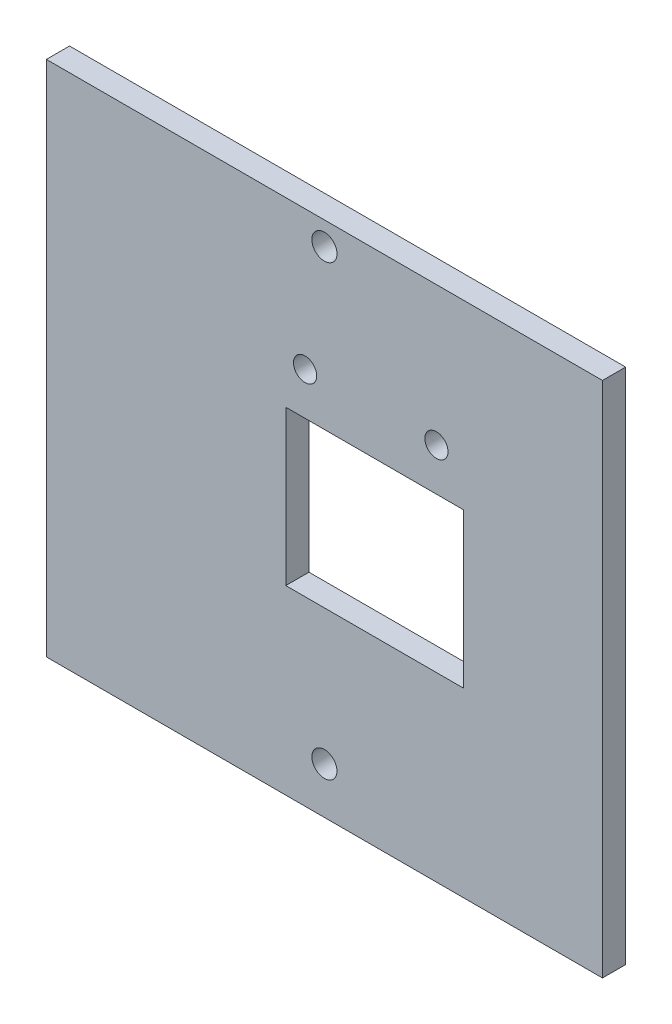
ISO-10303-21;
HEADER;
FILE_DESCRIPTION(('STEP AP214'),'2;1');
FILE_NAME('part.step','',(''),(''),'','','');
FILE_SCHEMA(('AUTOMOTIVE_DESIGN { 1 0 10303 214 1 1 1 1 }'));
ENDSEC;
DATA;
#1=APPLICATION_CONTEXT('core data for automotive mechanical design processes');
#2=APPLICATION_PROTOCOL_DEFINITION('international standard','automotive_design',2000,#1);
#3=PRODUCT_CONTEXT('',#1,'mechanical');
#4=PRODUCT('Part','Part','',(#3));
#5=PRODUCT_RELATED_PRODUCT_CATEGORY('part','',(#4));
#6=PRODUCT_DEFINITION_FORMATION('','',#4);
#7=PRODUCT_DEFINITION_CONTEXT('part definition',#1,'design');
#8=PRODUCT_DEFINITION('design','',#6,#7);
#9=PRODUCT_DEFINITION_SHAPE('','',#8);
#10=(LENGTH_UNIT() NAMED_UNIT(*) SI_UNIT(.MILLI.,.METRE.));
#11=(NAMED_UNIT(*) PLANE_ANGLE_UNIT() SI_UNIT($,.RADIAN.));
#12=(NAMED_UNIT(*) SI_UNIT($,.STERADIAN.) SOLID_ANGLE_UNIT());
#13=UNCERTAINTY_MEASURE_WITH_UNIT(LENGTH_MEASURE(1.E-05),#10,'distance_accuracy_value','');
#14=(GEOMETRIC_REPRESENTATION_CONTEXT(3) GLOBAL_UNCERTAINTY_ASSIGNED_CONTEXT((#13)) GLOBAL_UNIT_ASSIGNED_CONTEXT((#10,
#11,#12)) REPRESENTATION_CONTEXT('',''));
#15=CARTESIAN_POINT('',(0.,0.,0.));
#16=DIRECTION('',(0.,0.,1.));
#17=DIRECTION('',(1.,0.,0.));
#18=AXIS2_PLACEMENT_3D('',#15,#16,#17);
#19=CARTESIAN_POINT('',(119.049688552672,-53.1399541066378,3.));
#20=DIRECTION('',(-1.,0.,0.));
#21=DIRECTION('',(0.,0.,1.));
#22=AXIS2_PLACEMENT_3D('',#19,#20,#21);
#23=PLANE('',#22);
#24=DIRECTION('',(0.,1.,0.));
#25=VECTOR('',#24,1.);
#26=CARTESIAN_POINT('',(119.049688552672,-53.1399541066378,0.));
#27=LINE('',#26,#25);
#28=CARTESIAN_POINT('',(119.049688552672,-53.1399541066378,0.));
#29=VERTEX_POINT('',#28);
#30=CARTESIAN_POINT('',(119.049688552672,13.8600458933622,0.));
#31=VERTEX_POINT('',#30);
#32=EDGE_CURVE('E138',#29,#31,#27,.T.);
#33=ORIENTED_EDGE('',*,*,#32,.T.);
#34=DIRECTION('',(0.,0.,-1.));
#35=VECTOR('',#34,1.);
#36=CARTESIAN_POINT('',(119.049688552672,13.8600458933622,3.));
#37=LINE('',#36,#35);
#38=CARTESIAN_POINT('',(119.049688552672,13.8600458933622,3.));
#39=VERTEX_POINT('',#38);
#40=EDGE_CURVE('E11',#39,#31,#37,.T.);
#41=ORIENTED_EDGE('',*,*,#40,.F.);
#42=DIRECTION('',(0.,1.,0.));
#43=VECTOR('',#42,1.);
#44=CARTESIAN_POINT('',(119.049688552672,-53.1399541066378,3.));
#45=LINE('',#44,#43);
#46=CARTESIAN_POINT('',(119.049688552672,-53.1399541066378,3.));
#47=VERTEX_POINT('',#46);
#48=EDGE_CURVE('E142',#47,#39,#45,.T.);
#49=ORIENTED_EDGE('',*,*,#48,.F.);
#50=DIRECTION('',(0.,0.,-1.));
#51=VECTOR('',#50,1.);
#52=CARTESIAN_POINT('',(119.049688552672,-53.1399541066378,3.));
#53=LINE('',#52,#51);
#54=EDGE_CURVE('E152',#47,#29,#53,.T.);
#55=ORIENTED_EDGE('',*,*,#54,.T.);
#56=EDGE_LOOP('',(#33,#41,#49,#55));
#57=FACE_BOUND('',#56,.T.);
#58=ADVANCED_FACE('F37',(#57),#23,.F.);
#59=CARTESIAN_POINT('',(47.0496885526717,13.8600458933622,3.));
#60=DIRECTION('',(0.,-1.,0.));
#61=DIRECTION('',(0.,0.,-1.));
#62=AXIS2_PLACEMENT_3D('',#59,#60,#61);
#63=PLANE('',#62);
#64=DIRECTION('',(-1.,0.,0.));
#65=VECTOR('',#64,1.);
#66=CARTESIAN_POINT('',(47.0496885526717,13.8600458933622,0.));
#67=LINE('',#66,#65);
#68=CARTESIAN_POINT('',(47.0496885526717,13.8600458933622,0.));
#69=VERTEX_POINT('',#68);
#70=EDGE_CURVE('E155',#31,#69,#67,.T.);
#71=ORIENTED_EDGE('',*,*,#70,.T.);
#72=DIRECTION('',(0.,0.,-1.));
#73=VECTOR('',#72,1.);
#74=CARTESIAN_POINT('',(47.0496885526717,13.8600458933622,3.));
#75=LINE('',#74,#73);
#76=CARTESIAN_POINT('',(47.0496885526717,13.8600458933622,3.));
#77=VERTEX_POINT('',#76);
#78=EDGE_CURVE('E44',#77,#69,#75,.T.);
#79=ORIENTED_EDGE('',*,*,#78,.F.);
#80=DIRECTION('',(-1.,0.,0.));
#81=VECTOR('',#80,1.);
#82=CARTESIAN_POINT('',(47.0496885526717,13.8600458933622,3.));
#83=LINE('',#82,#81);
#84=EDGE_CURVE('E145',#39,#77,#83,.T.);
#85=ORIENTED_EDGE('',*,*,#84,.F.);
#86=ORIENTED_EDGE('',*,*,#40,.T.);
#87=EDGE_LOOP('',(#71,#79,#85,#86));
#88=FACE_BOUND('',#87,.T.);
#89=ADVANCED_FACE('F183',(#88),#63,.F.);
#90=CARTESIAN_POINT('',(47.0496885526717,-53.1399541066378,3.));
#91=DIRECTION('',(1.,0.,0.));
#92=DIRECTION('',(0.,0.,-1.));
#93=AXIS2_PLACEMENT_3D('',#90,#91,#92);
#94=PLANE('',#93);
#95=DIRECTION('',(0.,-1.,0.));
#96=VECTOR('',#95,1.);
#97=CARTESIAN_POINT('',(47.0496885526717,-53.1399541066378,0.));
#98=LINE('',#97,#96);
#99=CARTESIAN_POINT('',(47.0496885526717,-53.1399541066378,0.));
#100=VERTEX_POINT('',#99);
#101=EDGE_CURVE('E157',#69,#100,#98,.T.);
#102=ORIENTED_EDGE('',*,*,#101,.T.);
#103=DIRECTION('',(0.,0.,-1.));
#104=VECTOR('',#103,1.);
#105=CARTESIAN_POINT('',(47.0496885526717,-53.1399541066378,3.));
#106=LINE('',#105,#104);
#107=CARTESIAN_POINT('',(47.0496885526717,-53.1399541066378,3.));
#108=VERTEX_POINT('',#107);
#109=EDGE_CURVE('E162',#108,#100,#106,.T.);
#110=ORIENTED_EDGE('',*,*,#109,.F.);
#111=DIRECTION('',(0.,-1.,0.));
#112=VECTOR('',#111,1.);
#113=CARTESIAN_POINT('',(47.0496885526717,-53.1399541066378,3.));
#114=LINE('',#113,#112);
#115=EDGE_CURVE('E148',#77,#108,#114,.T.);
#116=ORIENTED_EDGE('',*,*,#115,.F.);
#117=ORIENTED_EDGE('',*,*,#78,.T.);
#118=EDGE_LOOP('',(#102,#110,#116,#117));
#119=FACE_BOUND('',#118,.T.);
#120=ADVANCED_FACE('F169',(#119),#94,.F.);
#121=CARTESIAN_POINT('',(47.0496885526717,-53.1399541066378,3.));
#122=DIRECTION('',(0.,1.,0.));
#123=DIRECTION('',(0.,0.,1.));
#124=AXIS2_PLACEMENT_3D('',#121,#122,#123);
#125=PLANE('',#124);
#126=DIRECTION('',(1.,0.,0.));
#127=VECTOR('',#126,1.);
#128=CARTESIAN_POINT('',(47.0496885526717,-53.1399541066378,0.));
#129=LINE('',#128,#127);
#130=EDGE_CURVE('E146',#100,#29,#129,.T.);
#131=ORIENTED_EDGE('',*,*,#130,.T.);
#132=ORIENTED_EDGE('',*,*,#54,.F.);
#133=DIRECTION('',(1.,0.,0.));
#134=VECTOR('',#133,1.);
#135=CARTESIAN_POINT('',(47.0496885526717,-53.1399541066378,3.));
#136=LINE('',#135,#134);
#137=EDGE_CURVE('E150',#108,#47,#136,.T.);
#138=ORIENTED_EDGE('',*,*,#137,.F.);
#139=ORIENTED_EDGE('',*,*,#109,.T.);
#140=EDGE_LOOP('',(#131,#132,#138,#139));
#141=FACE_BOUND('',#140,.T.);
#142=ADVANCED_FACE('F178',(#141),#125,.F.);
#143=CARTESIAN_POINT('',(0.,0.,3.));
#144=DIRECTION('',(0.,0.,-1.));
#145=DIRECTION('',(-1.,0.,0.));
#146=AXIS2_PLACEMENT_3D('',#143,#144,#145);
#147=PLANE('',#146);
#148=CARTESIAN_POINT('',(83.0496885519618,-47.1399541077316,3.));
#149=DIRECTION('',(0.,0.,-1.));
#150=DIRECTION('',(-1.,0.,0.));
#151=AXIS2_PLACEMENT_3D('',#148,#149,#150);
#152=CIRCLE('',#151,1.625);
#153=CARTESIAN_POINT('',(81.4246885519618,-47.1399541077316,3.));
#154=VERTEX_POINT('',#153);
#155=EDGE_CURVE('E131',#154,#154,#152,.T.);
#156=ORIENTED_EDGE('',*,*,#155,.T.);
#157=EDGE_LOOP('',(#156));
#158=FACE_BOUND('',#157,.T.);
#159=CARTESIAN_POINT('',(83.0496885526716,10.8600458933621,3.));
#160=DIRECTION('',(0.,0.,-1.));
#161=DIRECTION('',(-1.,0.,0.));
#162=AXIS2_PLACEMENT_3D('',#159,#160,#161);
#163=CIRCLE('',#162,1.625);
#164=CARTESIAN_POINT('',(81.4246885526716,10.8600458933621,3.));
#165=VERTEX_POINT('',#164);
#166=EDGE_CURVE('E248',#165,#165,#163,.T.);
#167=ORIENTED_EDGE('',*,*,#166,.T.);
#168=EDGE_LOOP('',(#167));
#169=FACE_BOUND('',#168,.T.);
#170=CARTESIAN_POINT('',(97.5496885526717,-4.13995410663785,3.));
#171=DIRECTION('',(0.,0.,-1.));
#172=DIRECTION('',(-1.,0.,0.));
#173=AXIS2_PLACEMENT_3D('',#170,#171,#172);
#174=CIRCLE('',#173,1.5);
#175=CARTESIAN_POINT('',(96.0496885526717,-4.13995410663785,3.));
#176=VERTEX_POINT('',#175);
#177=EDGE_CURVE('E230',#176,#176,#174,.T.);
#178=ORIENTED_EDGE('',*,*,#177,.T.);
#179=EDGE_LOOP('',(#178));
#180=FACE_BOUND('',#179,.T.);
#181=CARTESIAN_POINT('',(80.5496885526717,-4.13995410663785,3.));
#182=DIRECTION('',(0.,0.,-1.));
#183=DIRECTION('',(-1.,0.,0.));
#184=AXIS2_PLACEMENT_3D('',#181,#182,#183);
#185=CIRCLE('',#184,1.5);
#186=CARTESIAN_POINT('',(79.0496885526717,-4.13995410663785,3.));
#187=VERTEX_POINT('',#186);
#188=EDGE_CURVE('E235',#187,#187,#185,.T.);
#189=ORIENTED_EDGE('',*,*,#188,.T.);
#190=EDGE_LOOP('',(#189));
#191=FACE_BOUND('',#190,.T.);
#192=DIRECTION('',(0.,1.,0.));
#193=VECTOR('',#192,1.);
#194=CARTESIAN_POINT('',(78.0496885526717,-9.63995410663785,3.));
#195=LINE('',#194,#193);
#196=CARTESIAN_POINT('',(78.0496885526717,-29.6399541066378,3.));
#197=VERTEX_POINT('',#196);
#198=CARTESIAN_POINT('',(78.0496885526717,-9.63995410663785,3.));
#199=VERTEX_POINT('',#198);
#200=EDGE_CURVE('E108',#197,#199,#195,.T.);
#201=ORIENTED_EDGE('',*,*,#200,.T.);
#202=DIRECTION('',(1.,0.,0.));
#203=VECTOR('',#202,1.);
#204=CARTESIAN_POINT('',(101.049688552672,-9.63995410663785,3.));
#205=LINE('',#204,#203);
#206=CARTESIAN_POINT('',(101.049688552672,-9.63995410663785,3.));
#207=VERTEX_POINT('',#206);
#208=EDGE_CURVE('E102',#199,#207,#205,.T.);
#209=ORIENTED_EDGE('',*,*,#208,.T.);
#210=DIRECTION('',(0.,-1.,0.));
#211=VECTOR('',#210,1.);
#212=CARTESIAN_POINT('',(101.049688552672,-9.63995410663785,3.));
#213=LINE('',#212,#211);
#214=CARTESIAN_POINT('',(101.049688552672,-29.6399541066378,3.));
#215=VERTEX_POINT('',#214);
#216=EDGE_CURVE('E111',#207,#215,#213,.T.);
#217=ORIENTED_EDGE('',*,*,#216,.T.);
#218=DIRECTION('',(-1.,0.,0.));
#219=VECTOR('',#218,1.);
#220=CARTESIAN_POINT('',(81.0496885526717,-29.6399541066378,3.));
#221=LINE('',#220,#219);
#222=EDGE_CURVE('E51',#215,#197,#221,.T.);
#223=ORIENTED_EDGE('',*,*,#222,.T.);
#224=EDGE_LOOP('',(#201,#209,#217,#223));
#225=FACE_BOUND('',#224,.T.);
#226=ORIENTED_EDGE('',*,*,#48,.T.);
#227=ORIENTED_EDGE('',*,*,#84,.T.);
#228=ORIENTED_EDGE('',*,*,#115,.T.);
#229=ORIENTED_EDGE('',*,*,#137,.T.);
#230=EDGE_LOOP('',(#226,#227,#228,#229));
#231=FACE_BOUND('',#230,.T.);
#232=ADVANCED_FACE('F116',(#158,#169,#180,#191,#225,#231),#147,.F.);
#233=CARTESIAN_POINT('',(0.,0.,0.));
#234=DIRECTION('',(0.,0.,-1.));
#235=DIRECTION('',(-1.,0.,0.));
#236=AXIS2_PLACEMENT_3D('',#233,#234,#235);
#237=PLANE('',#236);
#238=CARTESIAN_POINT('',(83.0496885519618,-47.1399541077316,0.));
#239=DIRECTION('',(0.,0.,-1.));
#240=DIRECTION('',(-1.,0.,0.));
#241=AXIS2_PLACEMENT_3D('',#238,#239,#240);
#242=CIRCLE('',#241,1.625);
#243=CARTESIAN_POINT('',(81.4246885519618,-47.1399541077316,0.));
#244=VERTEX_POINT('',#243);
#245=EDGE_CURVE('E246',#244,#244,#242,.T.);
#246=ORIENTED_EDGE('',*,*,#245,.F.);
#247=EDGE_LOOP('',(#246));
#248=FACE_BOUND('',#247,.T.);
#249=CARTESIAN_POINT('',(83.0496885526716,10.8600458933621,0.));
#250=DIRECTION('',(0.,0.,-1.));
#251=DIRECTION('',(-1.,0.,0.));
#252=AXIS2_PLACEMENT_3D('',#249,#250,#251);
#253=CIRCLE('',#252,1.625);
#254=CARTESIAN_POINT('',(81.4246885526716,10.8600458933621,0.));
#255=VERTEX_POINT('',#254);
#256=EDGE_CURVE('E123',#255,#255,#253,.T.);
#257=ORIENTED_EDGE('',*,*,#256,.F.);
#258=EDGE_LOOP('',(#257));
#259=FACE_BOUND('',#258,.T.);
#260=CARTESIAN_POINT('',(97.5496885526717,-4.13995410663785,0.));
#261=DIRECTION('',(0.,0.,-1.));
#262=DIRECTION('',(-1.,0.,0.));
#263=AXIS2_PLACEMENT_3D('',#260,#261,#262);
#264=CIRCLE('',#263,1.5);
#265=CARTESIAN_POINT('',(96.0496885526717,-4.13995410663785,0.));
#266=VERTEX_POINT('',#265);
#267=EDGE_CURVE('E233',#266,#266,#264,.T.);
#268=ORIENTED_EDGE('',*,*,#267,.F.);
#269=EDGE_LOOP('',(#268));
#270=FACE_BOUND('',#269,.T.);
#271=CARTESIAN_POINT('',(80.5496885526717,-4.13995410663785,0.));
#272=DIRECTION('',(0.,0.,-1.));
#273=DIRECTION('',(-1.,0.,0.));
#274=AXIS2_PLACEMENT_3D('',#271,#272,#273);
#275=CIRCLE('',#274,1.5);
#276=CARTESIAN_POINT('',(79.0496885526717,-4.13995410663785,0.));
#277=VERTEX_POINT('',#276);
#278=EDGE_CURVE('E239',#277,#277,#275,.T.);
#279=ORIENTED_EDGE('',*,*,#278,.F.);
#280=EDGE_LOOP('',(#279));
#281=FACE_BOUND('',#280,.T.);
#282=DIRECTION('',(1.,0.,0.));
#283=VECTOR('',#282,1.);
#284=CARTESIAN_POINT('',(81.0496885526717,-9.63995410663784,0.));
#285=LINE('',#284,#283);
#286=CARTESIAN_POINT('',(78.0496885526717,-9.63995410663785,0.));
#287=VERTEX_POINT('',#286);
#288=CARTESIAN_POINT('',(101.049688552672,-9.63995410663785,0.));
#289=VERTEX_POINT('',#288);
#290=EDGE_CURVE('E105',#287,#289,#285,.T.);
#291=ORIENTED_EDGE('',*,*,#290,.F.);
#292=DIRECTION('',(0.,1.,0.));
#293=VECTOR('',#292,1.);
#294=CARTESIAN_POINT('',(78.0496885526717,-9.63995410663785,0.));
#295=LINE('',#294,#293);
#296=CARTESIAN_POINT('',(78.0496885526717,-29.6399541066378,0.));
#297=VERTEX_POINT('',#296);
#298=EDGE_CURVE('E120',#297,#287,#295,.T.);
#299=ORIENTED_EDGE('',*,*,#298,.F.);
#300=DIRECTION('',(-1.,0.,0.));
#301=VECTOR('',#300,1.);
#302=CARTESIAN_POINT('',(78.0496885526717,-29.6399541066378,0.));
#303=LINE('',#302,#301);
#304=CARTESIAN_POINT('',(101.049688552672,-29.6399541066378,0.));
#305=VERTEX_POINT('',#304);
#306=EDGE_CURVE('E130',#305,#297,#303,.T.);
#307=ORIENTED_EDGE('',*,*,#306,.F.);
#308=DIRECTION('',(0.,-1.,0.));
#309=VECTOR('',#308,1.);
#310=CARTESIAN_POINT('',(101.049688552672,-9.63995410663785,0.));
#311=LINE('',#310,#309);
#312=EDGE_CURVE('E128',#289,#305,#311,.T.);
#313=ORIENTED_EDGE('',*,*,#312,.F.);
#314=EDGE_LOOP('',(#291,#299,#307,#313));
#315=FACE_BOUND('',#314,.T.);
#316=ORIENTED_EDGE('',*,*,#32,.F.);
#317=ORIENTED_EDGE('',*,*,#130,.F.);
#318=ORIENTED_EDGE('',*,*,#101,.F.);
#319=ORIENTED_EDGE('',*,*,#70,.F.);
#320=EDGE_LOOP('',(#316,#317,#318,#319));
#321=FACE_BOUND('',#320,.T.);
#322=ADVANCED_FACE('F175',(#248,#259,#270,#281,#315,#321),#237,.T.);
#323=CARTESIAN_POINT('',(81.0496885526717,-9.63995410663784,3.));
#324=DIRECTION('',(0.,1.,0.));
#325=DIRECTION('',(-1.,0.,0.));
#326=AXIS2_PLACEMENT_3D('',#323,#324,#325);
#327=PLANE('',#326);
#328=ORIENTED_EDGE('',*,*,#290,.T.);
#329=DIRECTION('',(0.,0.,-1.));
#330=VECTOR('',#329,1.);
#331=CARTESIAN_POINT('',(101.049688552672,-9.63995410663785,3.));
#332=LINE('',#331,#330);
#333=EDGE_CURVE('E59',#207,#289,#332,.T.);
#334=ORIENTED_EDGE('',*,*,#333,.F.);
#335=ORIENTED_EDGE('',*,*,#208,.F.);
#336=DIRECTION('',(0.,0.,-1.));
#337=VECTOR('',#336,1.);
#338=CARTESIAN_POINT('',(78.0496885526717,-9.63995410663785,3.));
#339=LINE('',#338,#337);
#340=EDGE_CURVE('E136',#199,#287,#339,.T.);
#341=ORIENTED_EDGE('',*,*,#340,.T.);
#342=EDGE_LOOP('',(#328,#334,#335,#341));
#343=FACE_BOUND('',#342,.T.);
#344=ADVANCED_FACE('F100',(#343),#327,.F.);
#345=CARTESIAN_POINT('',(78.0496885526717,-9.63995410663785,3.));
#346=DIRECTION('',(-1.,0.,0.));
#347=DIRECTION('',(0.,0.,1.));
#348=AXIS2_PLACEMENT_3D('',#345,#346,#347);
#349=PLANE('',#348);
#350=ORIENTED_EDGE('',*,*,#298,.T.);
#351=ORIENTED_EDGE('',*,*,#340,.F.);
#352=ORIENTED_EDGE('',*,*,#200,.F.);
#353=DIRECTION('',(0.,0.,-1.));
#354=VECTOR('',#353,1.);
#355=CARTESIAN_POINT('',(78.0496885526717,-29.6399541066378,3.));
#356=LINE('',#355,#354);
#357=EDGE_CURVE('E139',#197,#297,#356,.T.);
#358=ORIENTED_EDGE('',*,*,#357,.T.);
#359=EDGE_LOOP('',(#350,#351,#352,#358));
#360=FACE_BOUND('',#359,.T.);
#361=ADVANCED_FACE('F205',(#360),#349,.F.);
#362=CARTESIAN_POINT('',(78.0496885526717,-29.6399541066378,3.));
#363=DIRECTION('',(0.,-1.,0.));
#364=DIRECTION('',(0.,0.,-1.));
#365=AXIS2_PLACEMENT_3D('',#362,#363,#364);
#366=PLANE('',#365);
#367=ORIENTED_EDGE('',*,*,#306,.T.);
#368=ORIENTED_EDGE('',*,*,#357,.F.);
#369=ORIENTED_EDGE('',*,*,#222,.F.);
#370=DIRECTION('',(0.,0.,-1.));
#371=VECTOR('',#370,1.);
#372=CARTESIAN_POINT('',(101.049688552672,-29.6399541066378,3.));
#373=LINE('',#372,#371);
#374=EDGE_CURVE('E107',#215,#305,#373,.T.);
#375=ORIENTED_EDGE('',*,*,#374,.T.);
#376=EDGE_LOOP('',(#367,#368,#369,#375));
#377=FACE_BOUND('',#376,.T.);
#378=ADVANCED_FACE('F202',(#377),#366,.F.);
#379=CARTESIAN_POINT('',(101.049688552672,-9.63995410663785,3.));
#380=DIRECTION('',(1.,0.,0.));
#381=DIRECTION('',(0.,1.,0.));
#382=AXIS2_PLACEMENT_3D('',#379,#380,#381);
#383=PLANE('',#382);
#384=ORIENTED_EDGE('',*,*,#312,.T.);
#385=ORIENTED_EDGE('',*,*,#374,.F.);
#386=ORIENTED_EDGE('',*,*,#216,.F.);
#387=ORIENTED_EDGE('',*,*,#333,.T.);
#388=EDGE_LOOP('',(#384,#385,#386,#387));
#389=FACE_BOUND('',#388,.T.);
#390=ADVANCED_FACE('F112',(#389),#383,.F.);
#391=CARTESIAN_POINT('',(80.5496885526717,-4.13995410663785,3.));
#392=DIRECTION('',(0.,0.,-1.));
#393=DIRECTION('',(-1.,0.,0.));
#394=AXIS2_PLACEMENT_3D('',#391,#392,#393);
#395=CYLINDRICAL_SURFACE('',#394,1.5);
#396=ORIENTED_EDGE('',*,*,#188,.F.);
#397=EDGE_LOOP('',(#396));
#398=FACE_BOUND('',#397,.T.);
#399=ORIENTED_EDGE('',*,*,#278,.T.);
#400=EDGE_LOOP('',(#399));
#401=FACE_BOUND('',#400,.T.);
#402=ADVANCED_FACE('F201',(#398,#401),#395,.F.);
#403=CARTESIAN_POINT('',(97.5496885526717,-4.13995410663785,3.));
#404=DIRECTION('',(0.,0.,-1.));
#405=DIRECTION('',(-1.,0.,0.));
#406=AXIS2_PLACEMENT_3D('',#403,#404,#405);
#407=CYLINDRICAL_SURFACE('',#406,1.5);
#408=ORIENTED_EDGE('',*,*,#177,.F.);
#409=EDGE_LOOP('',(#408));
#410=FACE_BOUND('',#409,.T.);
#411=ORIENTED_EDGE('',*,*,#267,.T.);
#412=EDGE_LOOP('',(#411));
#413=FACE_BOUND('',#412,.T.);
#414=ADVANCED_FACE('F215',(#410,#413),#407,.F.);
#415=CARTESIAN_POINT('',(83.0496885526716,10.8600458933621,3.));
#416=DIRECTION('',(0.,0.,-1.));
#417=DIRECTION('',(-1.,0.,0.));
#418=AXIS2_PLACEMENT_3D('',#415,#416,#417);
#419=CYLINDRICAL_SURFACE('',#418,1.625);
#420=ORIENTED_EDGE('',*,*,#166,.F.);
#421=EDGE_LOOP('',(#420));
#422=FACE_BOUND('',#421,.T.);
#423=ORIENTED_EDGE('',*,*,#256,.T.);
#424=EDGE_LOOP('',(#423));
#425=FACE_BOUND('',#424,.T.);
#426=ADVANCED_FACE('F211',(#422,#425),#419,.F.);
#427=CARTESIAN_POINT('',(83.0496885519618,-47.1399541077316,3.));
#428=DIRECTION('',(0.,0.,-1.));
#429=DIRECTION('',(-1.,0.,0.));
#430=AXIS2_PLACEMENT_3D('',#427,#428,#429);
#431=CYLINDRICAL_SURFACE('',#430,1.625);
#432=ORIENTED_EDGE('',*,*,#155,.F.);
#433=EDGE_LOOP('',(#432));
#434=FACE_BOUND('',#433,.T.);
#435=ORIENTED_EDGE('',*,*,#245,.T.);
#436=EDGE_LOOP('',(#435));
#437=FACE_BOUND('',#436,.T.);
#438=ADVANCED_FACE('F214',(#434,#437),#431,.F.);
#439=CLOSED_SHELL('',(#58,#89,#120,#142,#232,#322,#344,#361,#378,#390,#402,#414,#426,#438));
#440=MANIFOLD_SOLID_BREP('B2',#439);
#441=ADVANCED_BREP_SHAPE_REPRESENTATION('',(#18,#440),#14);
#442=SHAPE_DEFINITION_REPRESENTATION(#9,#441);
ENDSEC;
END-ISO-10303-21;
